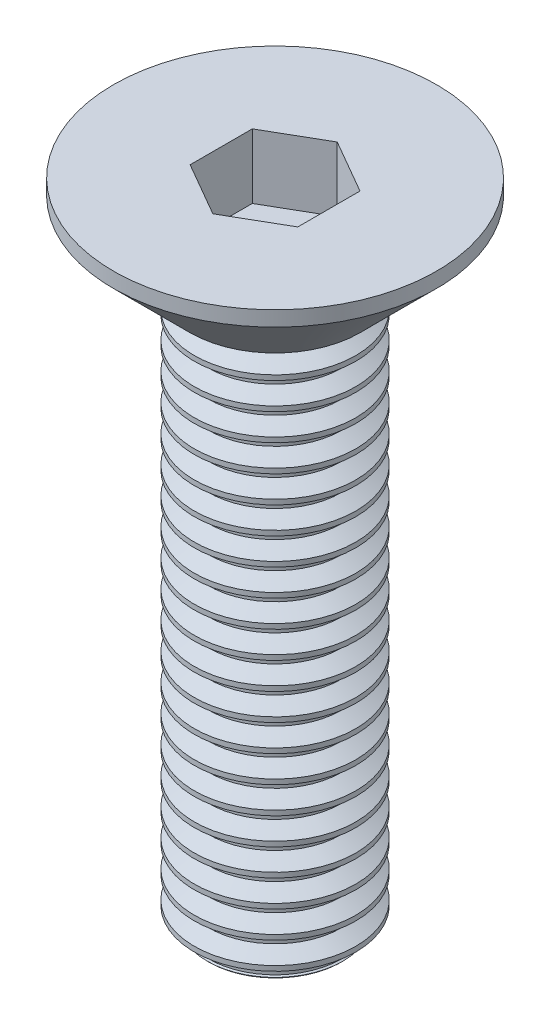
from build123d import *

# Parameters (mm, degrees)
GRIP_DEPTH          = 1.2
THREAD_SIMPLE_COUNT = 21
THREAD_SIMPLE_PITCH = 0.5


with BuildPart() as part:
    # Sketch2 → Body (revolve)
    with BuildSketch(Plane.XY):
        Polygon((0, -12), (1.226987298, -12), (1.5, -11.726987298), (1.5, -1.7), (1.58, -1.7), (3, -0.28), (3, 0), (0, 0), align=None)
    revolve(axis=Axis((0, 0, 0), (0, -1, 0)))

    # Sketch7 → Grip (cut)
    with BuildSketch(Plane(origin=(0, 0, 0), x_dir=(1, 0, 0), z_dir=(0, 1, 0))):
        Polygon((1, -0.577350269), (1, 0.577350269), (0, 1.154700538), (-1, 0.577350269), (-1, -0.577350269), (0, -1.154700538), align=None)
    extrude(amount=-GRIP_DEPTH, mode=Mode.SUBTRACT)

    # Sketch3 → Thread-Single (revolve, cut)
    with BuildSketch(Plane.XY):
        Polygon((1.5, -1.7), (1.226987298, -1.857623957), (1.226987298, -1.95), (1.5, -2.107623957), align=None)
    thread_single = revolve(axis=Axis((0, -12, 0), (0, 1, 0)), mode=Mode.SUBTRACT)

    # Thread-Simple: Thread-Single ×21
    with Locations(*[(0, -i * THREAD_SIMPLE_PITCH, 0) for i in range(1, THREAD_SIMPLE_COUNT)]):
        add(thread_single, mode=Mode.SUBTRACT)


solid = part.part
